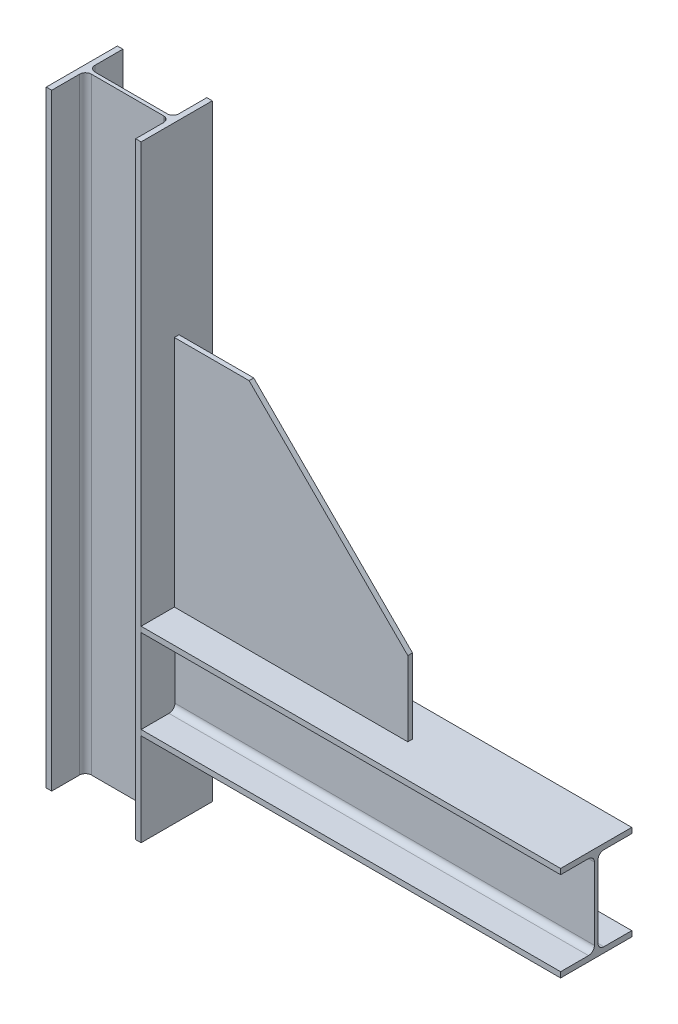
from build123d import *

# Parameters (mm, degrees)
AL_I_BEAM_AL_I_BEAM_4X2_31_1_DEPTH   = 650
AL_I_BEAM_AL_I_BEAM_4X2_31_1_2_DEPTH = 501
GUSSET1_THICKNESS                    = 5


with BuildPart() as part:
    # Sketch12 → Al i beam AL I BEAM 4X2.31_1 (new body)
    with BuildSketch(Plane(origin=(0, 500, 0), x_dir=(0, 0, 1), z_dir=(0, -1, 0))):
        with BuildLine():
            Line((-38.1, -50.8), (-38.1, -44.958))
            Line((-38.1, -44.958), (-8.255, -44.958))
            ThreePointArc((-8.255, -44.958), (-3.764871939, -43.098128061), (-1.905, -38.608))
            Line((-1.905, -38.608), (-1.905, 38.608))
            ThreePointArc((-1.905, 38.608), (-3.764871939, 43.098128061), (-8.255, 44.958))
            Line((-8.255, 44.958), (-38.1, 44.958))
            Line((-38.1, 44.958), (-38.1, 50.8))
            Line((-38.1, 50.8), (38.1, 50.8))
            Line((38.1, 50.8), (38.1, 44.958))
            Line((38.1, 44.958), (8.255, 44.958))
            ThreePointArc((8.255, 44.958), (3.764871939, 43.098128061), (1.905, 38.608))
            Line((1.905, 38.608), (1.905, -38.608))
            ThreePointArc((1.905, -38.608), (3.764871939, -43.098128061), (8.255, -44.958))
            Line((8.255, -44.958), (38.1, -44.958))
            Line((38.1, -44.958), (38.1, -50.8))
            Line((38.1, -50.8), (-38.1, -50.8))
        make_face()
    extrude(amount=AL_I_BEAM_AL_I_BEAM_4X2_31_1_DEPTH)


with BuildPart() as body_2:
    # Sketch12 on segment 2 (on carried to segment 2) → Al i beam AL I BEAM 4X2.31_1 2 (new body)
    with BuildSketch(Plane(origin=(-1, 0, 0), x_dir=(0, 0, 1), z_dir=(1, 0, 0))):
        with BuildLine():
            Line((-38.1, -50.8), (-38.1, -44.958))
            Line((-38.1, -44.958), (-8.255, -44.958))
            ThreePointArc((-8.255, -44.958), (-3.764871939, -43.098128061), (-1.905, -38.608))
            Line((-1.905, -38.608), (-1.905, 38.608))
            ThreePointArc((-1.905, 38.608), (-3.764871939, 43.098128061), (-8.255, 44.958))
            Line((-8.255, 44.958), (-38.1, 44.958))
            Line((-38.1, 44.958), (-38.1, 50.8))
            Line((-38.1, 50.8), (38.1, 50.8))
            Line((38.1, 50.8), (38.1, 44.958))
            Line((38.1, 44.958), (8.255, 44.958))
            ThreePointArc((8.255, 44.958), (3.764871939, 43.098128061), (1.905, 38.608))
            Line((1.905, 38.608), (1.905, -38.608))
            ThreePointArc((1.905, -38.608), (3.764871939, -43.098128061), (8.255, -44.958))
            Line((8.255, -44.958), (38.1, -44.958))
            Line((38.1, -44.958), (38.1, -50.8))
            Line((38.1, -50.8), (-38.1, -50.8))
        make_face()
    extrude(amount=AL_I_BEAM_AL_I_BEAM_4X2_31_1_2_DEPTH)

    # Al i beam AL I BEAM 4X2.31_1 2 end butt
    split(bisect_by=Plane.YZ.offset(50.8), keep=Keep.TOP)


with BuildPart() as body_3:
    # Gusset1: a gusset: a plate 5.0 thick in the corner of two members, its outline drawn in place
    gusset1_outline = Wire([Line((50.8, 50.8, -2.5), (50.8, 300.8, -2.5)), Line((50.8, 300.8, -2.5), (130.8, 300.8, -2.5)), Line((130.8, 300.8, -2.5), (300.8, 130.8, -2.5)), Line((300.8, 130.8, -2.5), (300.8, 50.8, -2.5)), Line((300.8, 50.8, -2.5), (50.8, 50.8, -2.5))])
    add(extrude(Face(gusset1_outline), amount=GUSSET1_THICKNESS, dir=(0, 0, 1)))


solid = Compound([part.part, body_2.part, body_3.part])
